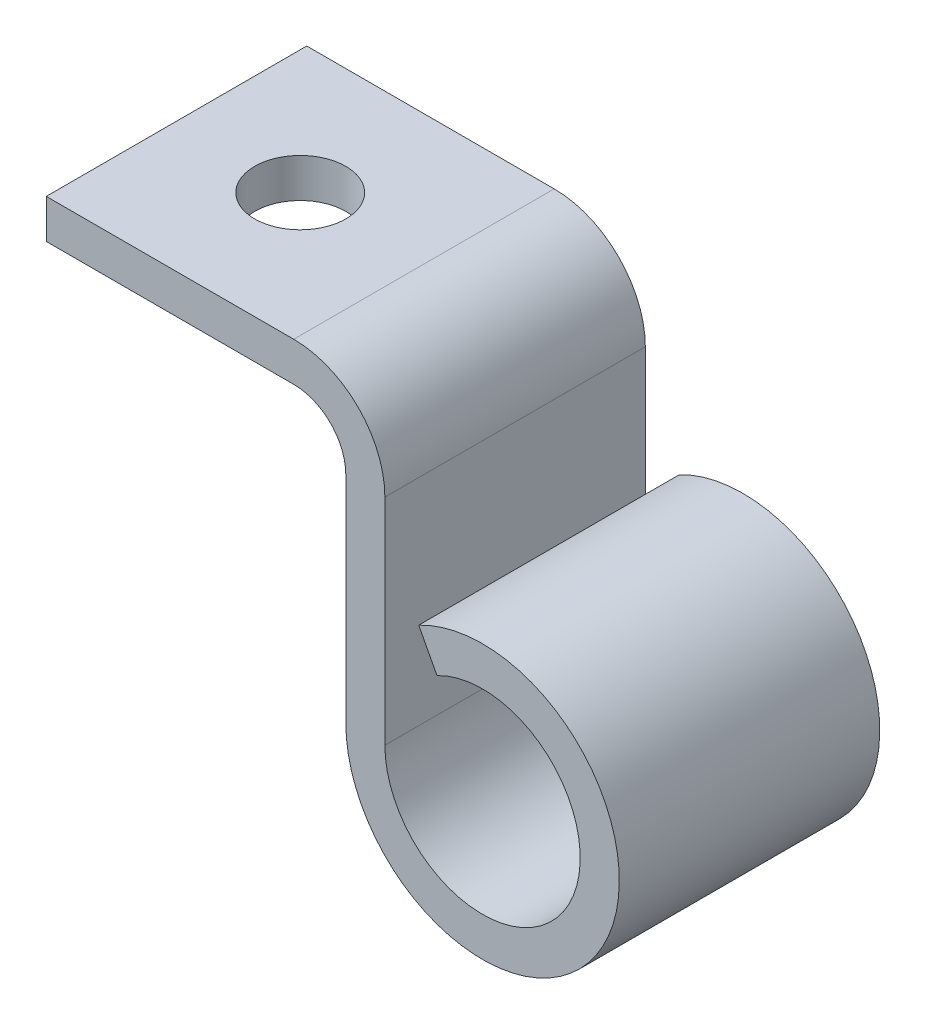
ISO-10303-21;
HEADER;
FILE_DESCRIPTION(('STEP AP214'),'2;1');
FILE_NAME('part.step','',(''),(''),'','','');
FILE_SCHEMA(('AUTOMOTIVE_DESIGN { 1 0 10303 214 1 1 1 1 }'));
ENDSEC;
DATA;
#1=APPLICATION_CONTEXT('core data for automotive mechanical design processes');
#2=APPLICATION_PROTOCOL_DEFINITION('international standard','automotive_design',2000,#1);
#3=PRODUCT_CONTEXT('',#1,'mechanical');
#4=PRODUCT('Part','Part','',(#3));
#5=PRODUCT_RELATED_PRODUCT_CATEGORY('part','',(#4));
#6=PRODUCT_DEFINITION_FORMATION('','',#4);
#7=PRODUCT_DEFINITION_CONTEXT('part definition',#1,'design');
#8=PRODUCT_DEFINITION('design','',#6,#7);
#9=PRODUCT_DEFINITION_SHAPE('','',#8);
#10=(LENGTH_UNIT() NAMED_UNIT(*) SI_UNIT(.MILLI.,.METRE.));
#11=(NAMED_UNIT(*) PLANE_ANGLE_UNIT() SI_UNIT($,.RADIAN.));
#12=(NAMED_UNIT(*) SI_UNIT($,.STERADIAN.) SOLID_ANGLE_UNIT());
#13=UNCERTAINTY_MEASURE_WITH_UNIT(LENGTH_MEASURE(1.E-05),#10,'distance_accuracy_value','');
#14=(GEOMETRIC_REPRESENTATION_CONTEXT(3) GLOBAL_UNCERTAINTY_ASSIGNED_CONTEXT((#13)) GLOBAL_UNIT_ASSIGNED_CONTEXT((#10,
#11,#12)) REPRESENTATION_CONTEXT('',''));
#15=CARTESIAN_POINT('',(0.,0.,0.));
#16=DIRECTION('',(0.,0.,1.));
#17=DIRECTION('',(1.,0.,0.));
#18=AXIS2_PLACEMENT_3D('',#15,#16,#17);
#19=CARTESIAN_POINT('',(0.,0.,10.));
#20=DIRECTION('',(0.,0.,-1.));
#21=DIRECTION('',(-1.,0.,0.));
#22=AXIS2_PLACEMENT_3D('',#19,#20,#21);
#23=CYLINDRICAL_SURFACE('',#22,10.5);
#24=CARTESIAN_POINT('',(0.,0.,-10.));
#25=DIRECTION('',(0.,0.,1.));
#26=DIRECTION('',(1.,0.,0.));
#27=AXIS2_PLACEMENT_3D('',#24,#25,#26);
#28=CIRCLE('',#27,10.5);
#29=CARTESIAN_POINT('',(-10.5,0.,-10.));
#30=VERTEX_POINT('',#29);
#31=CARTESIAN_POINT('',(-4.9,9.28654941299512,-10.));
#32=VERTEX_POINT('',#31);
#33=EDGE_CURVE('E139',#30,#32,#28,.T.);
#34=ORIENTED_EDGE('',*,*,#33,.T.);
#35=DIRECTION('',(0.,0.,-1.));
#36=VECTOR('',#35,1.);
#37=CARTESIAN_POINT('',(-4.9,9.28654941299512,10.));
#38=LINE('',#37,#36);
#39=CARTESIAN_POINT('',(-4.9,9.28654941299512,10.));
#40=VERTEX_POINT('',#39);
#41=EDGE_CURVE('E11',#40,#32,#38,.T.);
#42=ORIENTED_EDGE('',*,*,#41,.F.);
#43=CARTESIAN_POINT('',(0.,0.,10.));
#44=DIRECTION('',(0.,0.,1.));
#45=DIRECTION('',(1.,0.,0.));
#46=AXIS2_PLACEMENT_3D('',#43,#44,#45);
#47=CIRCLE('',#46,10.5);
#48=CARTESIAN_POINT('',(-10.5,0.,10.));
#49=VERTEX_POINT('',#48);
#50=EDGE_CURVE('E94',#49,#40,#47,.T.);
#51=ORIENTED_EDGE('',*,*,#50,.F.);
#52=DIRECTION('',(0.,0.,-1.));
#53=VECTOR('',#52,1.);
#54=CARTESIAN_POINT('',(-10.5,0.,10.));
#55=LINE('',#54,#53);
#56=EDGE_CURVE('E135',#49,#30,#55,.T.);
#57=ORIENTED_EDGE('',*,*,#56,.T.);
#58=EDGE_LOOP('',(#34,#42,#51,#57));
#59=FACE_BOUND('',#58,.T.);
#60=ADVANCED_FACE('F31',(#59),#23,.T.);
#61=CARTESIAN_POINT('',(-3.5,6.6332495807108,10.));
#62=DIRECTION('',(-0.884433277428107,-0.466666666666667,0.));
#63=DIRECTION('',(0.466666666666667,-0.884433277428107,0.));
#64=AXIS2_PLACEMENT_3D('',#61,#62,#63);
#65=PLANE('',#64);
#66=DIRECTION('',(-0.466666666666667,0.884433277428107,0.));
#67=VECTOR('',#66,1.);
#68=CARTESIAN_POINT('',(-3.5,6.6332495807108,-10.));
#69=LINE('',#68,#67);
#70=CARTESIAN_POINT('',(-3.5,6.6332495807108,-10.));
#71=VERTEX_POINT('',#70);
#72=EDGE_CURVE('E142',#71,#32,#69,.T.);
#73=ORIENTED_EDGE('',*,*,#72,.F.);
#74=DIRECTION('',(0.,0.,-1.));
#75=VECTOR('',#74,1.);
#76=CARTESIAN_POINT('',(-3.5,6.6332495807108,10.));
#77=LINE('',#76,#75);
#78=CARTESIAN_POINT('',(-3.5,6.6332495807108,10.));
#79=VERTEX_POINT('',#78);
#80=EDGE_CURVE('E40',#79,#71,#77,.T.);
#81=ORIENTED_EDGE('',*,*,#80,.F.);
#82=DIRECTION('',(-0.466666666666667,0.884433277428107,0.));
#83=VECTOR('',#82,1.);
#84=CARTESIAN_POINT('',(-3.5,6.6332495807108,10.));
#85=LINE('',#84,#83);
#86=EDGE_CURVE('E196',#79,#40,#85,.T.);
#87=ORIENTED_EDGE('',*,*,#86,.T.);
#88=ORIENTED_EDGE('',*,*,#41,.T.);
#89=EDGE_LOOP('',(#73,#81,#87,#88));
#90=FACE_BOUND('',#89,.T.);
#91=ADVANCED_FACE('F183',(#90),#65,.T.);
#92=CARTESIAN_POINT('',(0.,0.,10.));
#93=DIRECTION('',(0.,0.,-1.));
#94=DIRECTION('',(-1.,0.,0.));
#95=AXIS2_PLACEMENT_3D('',#92,#93,#94);
#96=CYLINDRICAL_SURFACE('',#95,7.5);
#97=CARTESIAN_POINT('',(0.,0.,-10.));
#98=DIRECTION('',(0.,0.,1.));
#99=DIRECTION('',(1.,0.,0.));
#100=AXIS2_PLACEMENT_3D('',#97,#98,#99);
#101=CIRCLE('',#100,7.5);
#102=CARTESIAN_POINT('',(-7.5,0.,-10.));
#103=VERTEX_POINT('',#102);
#104=EDGE_CURVE('E145',#103,#71,#101,.T.);
#105=ORIENTED_EDGE('',*,*,#104,.F.);
#106=DIRECTION('',(0.,0.,-1.));
#107=VECTOR('',#106,1.);
#108=CARTESIAN_POINT('',(-7.5,0.,10.));
#109=LINE('',#108,#107);
#110=CARTESIAN_POINT('',(-7.5,0.,10.));
#111=VERTEX_POINT('',#110);
#112=EDGE_CURVE('E172',#111,#103,#109,.T.);
#113=ORIENTED_EDGE('',*,*,#112,.F.);
#114=CARTESIAN_POINT('',(0.,0.,10.));
#115=DIRECTION('',(0.,0.,1.));
#116=DIRECTION('',(1.,0.,0.));
#117=AXIS2_PLACEMENT_3D('',#114,#115,#116);
#118=CIRCLE('',#117,7.5);
#119=EDGE_CURVE('E180',#111,#79,#118,.T.);
#120=ORIENTED_EDGE('',*,*,#119,.T.);
#121=ORIENTED_EDGE('',*,*,#80,.T.);
#122=EDGE_LOOP('',(#105,#113,#120,#121));
#123=FACE_BOUND('',#122,.T.);
#124=ADVANCED_FACE('F178',(#123),#96,.F.);
#125=CARTESIAN_POINT('',(-7.5,0.,10.));
#126=DIRECTION('',(1.,0.,0.));
#127=DIRECTION('',(0.,0.,-1.));
#128=AXIS2_PLACEMENT_3D('',#125,#126,#127);
#129=PLANE('',#128);
#130=DIRECTION('',(0.,-1.,0.));
#131=VECTOR('',#130,1.);
#132=CARTESIAN_POINT('',(-7.5,0.,-10.));
#133=LINE('',#132,#131);
#134=CARTESIAN_POINT('',(-7.5,16.5,-10.));
#135=VERTEX_POINT('',#134);
#136=EDGE_CURVE('E148',#135,#103,#133,.T.);
#137=ORIENTED_EDGE('',*,*,#136,.F.);
#138=DIRECTION('',(0.,0.,-1.));
#139=VECTOR('',#138,1.);
#140=CARTESIAN_POINT('',(-7.5,16.5,10.));
#141=LINE('',#140,#139);
#142=CARTESIAN_POINT('',(-7.5,16.5,10.));
#143=VERTEX_POINT('',#142);
#144=EDGE_CURVE('E170',#143,#135,#141,.T.);
#145=ORIENTED_EDGE('',*,*,#144,.F.);
#146=DIRECTION('',(0.,-1.,0.));
#147=VECTOR('',#146,1.);
#148=CARTESIAN_POINT('',(-7.5,0.,10.));
#149=LINE('',#148,#147);
#150=EDGE_CURVE('E193',#143,#111,#149,.T.);
#151=ORIENTED_EDGE('',*,*,#150,.T.);
#152=ORIENTED_EDGE('',*,*,#112,.T.);
#153=EDGE_LOOP('',(#137,#145,#151,#152));
#154=FACE_BOUND('',#153,.T.);
#155=ADVANCED_FACE('F190',(#154),#129,.T.);
#156=CARTESIAN_POINT('',(-14.5,16.5,10.));
#157=DIRECTION('',(0.,0.,-1.));
#158=DIRECTION('',(-1.,0.,0.));
#159=AXIS2_PLACEMENT_3D('',#156,#157,#158);
#160=CYLINDRICAL_SURFACE('',#159,7.);
#161=CARTESIAN_POINT('',(-14.5,16.5,-10.));
#162=DIRECTION('',(0.,0.,-1.));
#163=DIRECTION('',(1.,0.,0.));
#164=AXIS2_PLACEMENT_3D('',#161,#162,#163);
#165=CIRCLE('',#164,7.);
#166=CARTESIAN_POINT('',(-14.5,23.5,-10.));
#167=VERTEX_POINT('',#166);
#168=EDGE_CURVE('E151',#167,#135,#165,.T.);
#169=ORIENTED_EDGE('',*,*,#168,.F.);
#170=DIRECTION('',(0.,0.,-1.));
#171=VECTOR('',#170,1.);
#172=CARTESIAN_POINT('',(-14.5,23.5,10.));
#173=LINE('',#172,#171);
#174=CARTESIAN_POINT('',(-14.5,23.5,10.));
#175=VERTEX_POINT('',#174);
#176=EDGE_CURVE('E168',#175,#167,#173,.T.);
#177=ORIENTED_EDGE('',*,*,#176,.F.);
#178=CARTESIAN_POINT('',(-14.5,16.5,10.));
#179=DIRECTION('',(0.,0.,-1.));
#180=DIRECTION('',(1.,0.,0.));
#181=AXIS2_PLACEMENT_3D('',#178,#179,#180);
#182=CIRCLE('',#181,7.);
#183=EDGE_CURVE('E198',#175,#143,#182,.T.);
#184=ORIENTED_EDGE('',*,*,#183,.T.);
#185=ORIENTED_EDGE('',*,*,#144,.T.);
#186=EDGE_LOOP('',(#169,#177,#184,#185));
#187=FACE_BOUND('',#186,.T.);
#188=ADVANCED_FACE('F232',(#187),#160,.T.);
#189=CARTESIAN_POINT('',(-14.5,23.5,10.));
#190=DIRECTION('',(0.,1.,0.));
#191=DIRECTION('',(-1.,0.,0.));
#192=AXIS2_PLACEMENT_3D('',#189,#190,#191);
#193=PLANE('',#192);
#194=CARTESIAN_POINT('',(-24.,23.5,0.));
#195=DIRECTION('',(0.,1.,0.));
#196=DIRECTION('',(-1.,0.,0.));
#197=AXIS2_PLACEMENT_3D('',#194,#195,#196);
#198=CIRCLE('',#197,3.5);
#199=CARTESIAN_POINT('',(-27.5,23.5,0.));
#200=VERTEX_POINT('',#199);
#201=EDGE_CURVE('E250',#200,#200,#198,.T.);
#202=ORIENTED_EDGE('',*,*,#201,.F.);
#203=EDGE_LOOP('',(#202));
#204=FACE_BOUND('',#203,.T.);
#205=DIRECTION('',(1.,0.,0.));
#206=VECTOR('',#205,1.);
#207=CARTESIAN_POINT('',(-14.5,23.5,-10.));
#208=LINE('',#207,#206);
#209=CARTESIAN_POINT('',(-33.5,23.5,-10.));
#210=VERTEX_POINT('',#209);
#211=EDGE_CURVE('E154',#210,#167,#208,.T.);
#212=ORIENTED_EDGE('',*,*,#211,.F.);
#213=DIRECTION('',(0.,0.,-1.));
#214=VECTOR('',#213,1.);
#215=CARTESIAN_POINT('',(-33.5,23.5,10.));
#216=LINE('',#215,#214);
#217=CARTESIAN_POINT('',(-33.5,23.5,10.));
#218=VERTEX_POINT('',#217);
#219=EDGE_CURVE('E166',#218,#210,#216,.T.);
#220=ORIENTED_EDGE('',*,*,#219,.F.);
#221=DIRECTION('',(1.,0.,0.));
#222=VECTOR('',#221,1.);
#223=CARTESIAN_POINT('',(-14.5,23.5,10.));
#224=LINE('',#223,#222);
#225=EDGE_CURVE('E204',#218,#175,#224,.T.);
#226=ORIENTED_EDGE('',*,*,#225,.T.);
#227=ORIENTED_EDGE('',*,*,#176,.T.);
#228=EDGE_LOOP('',(#212,#220,#226,#227));
#229=FACE_BOUND('',#228,.T.);
#230=ADVANCED_FACE('F235',(#204,#229),#193,.T.);
#231=CARTESIAN_POINT('',(-33.5,20.5,10.));
#232=DIRECTION('',(-1.,0.,0.));
#233=DIRECTION('',(0.,0.,1.));
#234=AXIS2_PLACEMENT_3D('',#231,#232,#233);
#235=PLANE('',#234);
#236=DIRECTION('',(0.,1.,0.));
#237=VECTOR('',#236,1.);
#238=CARTESIAN_POINT('',(-33.5,20.5,-10.));
#239=LINE('',#238,#237);
#240=CARTESIAN_POINT('',(-33.5,20.5,-10.));
#241=VERTEX_POINT('',#240);
#242=EDGE_CURVE('E157',#241,#210,#239,.T.);
#243=ORIENTED_EDGE('',*,*,#242,.F.);
#244=DIRECTION('',(0.,0.,-1.));
#245=VECTOR('',#244,1.);
#246=CARTESIAN_POINT('',(-33.5,20.5,10.));
#247=LINE('',#246,#245);
#248=CARTESIAN_POINT('',(-33.5,20.5,10.));
#249=VERTEX_POINT('',#248);
#250=EDGE_CURVE('E130',#249,#241,#247,.T.);
#251=ORIENTED_EDGE('',*,*,#250,.F.);
#252=DIRECTION('',(0.,1.,0.));
#253=VECTOR('',#252,1.);
#254=CARTESIAN_POINT('',(-33.5,20.5,10.));
#255=LINE('',#254,#253);
#256=EDGE_CURVE('E123',#249,#218,#255,.T.);
#257=ORIENTED_EDGE('',*,*,#256,.T.);
#258=ORIENTED_EDGE('',*,*,#219,.T.);
#259=EDGE_LOOP('',(#243,#251,#257,#258));
#260=FACE_BOUND('',#259,.T.);
#261=ADVANCED_FACE('F208',(#260),#235,.T.);
#262=CARTESIAN_POINT('',(-14.5,20.5,10.));
#263=DIRECTION('',(0.,1.,0.));
#264=DIRECTION('',(-1.,0.,0.));
#265=AXIS2_PLACEMENT_3D('',#262,#263,#264);
#266=PLANE('',#265);
#267=CARTESIAN_POINT('',(-24.,20.5,0.));
#268=DIRECTION('',(0.,1.,0.));
#269=DIRECTION('',(-1.,0.,0.));
#270=AXIS2_PLACEMENT_3D('',#267,#268,#269);
#271=CIRCLE('',#270,3.5);
#272=CARTESIAN_POINT('',(-27.5,20.5,0.));
#273=VERTEX_POINT('',#272);
#274=EDGE_CURVE('E34',#273,#273,#271,.T.);
#275=ORIENTED_EDGE('',*,*,#274,.T.);
#276=EDGE_LOOP('',(#275));
#277=FACE_BOUND('',#276,.T.);
#278=DIRECTION('',(1.,0.,0.));
#279=VECTOR('',#278,1.);
#280=CARTESIAN_POINT('',(-14.5,20.5,-10.));
#281=LINE('',#280,#279);
#282=CARTESIAN_POINT('',(-14.5,20.5,-10.));
#283=VERTEX_POINT('',#282);
#284=EDGE_CURVE('E129',#241,#283,#281,.T.);
#285=ORIENTED_EDGE('',*,*,#284,.T.);
#286=DIRECTION('',(0.,0.,-1.));
#287=VECTOR('',#286,1.);
#288=CARTESIAN_POINT('',(-14.5,20.5,10.));
#289=LINE('',#288,#287);
#290=CARTESIAN_POINT('',(-14.5,20.5,10.));
#291=VERTEX_POINT('',#290);
#292=EDGE_CURVE('E126',#291,#283,#289,.T.);
#293=ORIENTED_EDGE('',*,*,#292,.F.);
#294=DIRECTION('',(1.,0.,0.));
#295=VECTOR('',#294,1.);
#296=CARTESIAN_POINT('',(-14.5,20.5,10.));
#297=LINE('',#296,#295);
#298=EDGE_CURVE('E116',#249,#291,#297,.T.);
#299=ORIENTED_EDGE('',*,*,#298,.F.);
#300=ORIENTED_EDGE('',*,*,#250,.T.);
#301=EDGE_LOOP('',(#285,#293,#299,#300));
#302=FACE_BOUND('',#301,.T.);
#303=ADVANCED_FACE('F127',(#277,#302),#266,.F.);
#304=CARTESIAN_POINT('',(-14.5,16.5,10.));
#305=DIRECTION('',(0.,0.,-1.));
#306=DIRECTION('',(-1.,0.,0.));
#307=AXIS2_PLACEMENT_3D('',#304,#305,#306);
#308=CYLINDRICAL_SURFACE('',#307,4.);
#309=CARTESIAN_POINT('',(-14.5,16.5,-10.));
#310=DIRECTION('',(0.,0.,1.));
#311=DIRECTION('',(1.,0.,0.));
#312=AXIS2_PLACEMENT_3D('',#309,#310,#311);
#313=CIRCLE('',#312,4.);
#314=CARTESIAN_POINT('',(-10.5,16.5,-10.));
#315=VERTEX_POINT('',#314);
#316=EDGE_CURVE('E82',#283,#315,#313,.F.);
#317=ORIENTED_EDGE('',*,*,#316,.T.);
#318=DIRECTION('',(0.,0.,-1.));
#319=VECTOR('',#318,1.);
#320=CARTESIAN_POINT('',(-10.5,16.5,10.));
#321=LINE('',#320,#319);
#322=CARTESIAN_POINT('',(-10.5,16.5,10.));
#323=VERTEX_POINT('',#322);
#324=EDGE_CURVE('E131',#323,#315,#321,.T.);
#325=ORIENTED_EDGE('',*,*,#324,.F.);
#326=CARTESIAN_POINT('',(-14.5,16.5,10.));
#327=DIRECTION('',(0.,0.,1.));
#328=DIRECTION('',(1.,0.,0.));
#329=AXIS2_PLACEMENT_3D('',#326,#327,#328);
#330=CIRCLE('',#329,4.);
#331=EDGE_CURVE('E120',#291,#323,#330,.F.);
#332=ORIENTED_EDGE('',*,*,#331,.F.);
#333=ORIENTED_EDGE('',*,*,#292,.T.);
#334=EDGE_LOOP('',(#317,#325,#332,#333));
#335=FACE_BOUND('',#334,.T.);
#336=ADVANCED_FACE('F133',(#335),#308,.F.);
#337=CARTESIAN_POINT('',(-10.5,0.,10.));
#338=DIRECTION('',(1.,0.,0.));
#339=DIRECTION('',(0.,0.,-1.));
#340=AXIS2_PLACEMENT_3D('',#337,#338,#339);
#341=PLANE('',#340);
#342=DIRECTION('',(0.,1.,0.));
#343=VECTOR('',#342,1.);
#344=CARTESIAN_POINT('',(-10.5,0.,-10.));
#345=LINE('',#344,#343);
#346=EDGE_CURVE('E88',#315,#30,#345,.F.);
#347=ORIENTED_EDGE('',*,*,#346,.T.);
#348=ORIENTED_EDGE('',*,*,#56,.F.);
#349=DIRECTION('',(0.,1.,0.));
#350=VECTOR('',#349,1.);
#351=CARTESIAN_POINT('',(-10.5,0.,10.));
#352=LINE('',#351,#350);
#353=EDGE_CURVE('E48',#323,#49,#352,.F.);
#354=ORIENTED_EDGE('',*,*,#353,.F.);
#355=ORIENTED_EDGE('',*,*,#324,.T.);
#356=EDGE_LOOP('',(#347,#348,#354,#355));
#357=FACE_BOUND('',#356,.T.);
#358=ADVANCED_FACE('F211',(#357),#341,.F.);
#359=CARTESIAN_POINT('',(0.,0.,10.));
#360=DIRECTION('',(0.,0.,1.));
#361=DIRECTION('',(1.,0.,0.));
#362=AXIS2_PLACEMENT_3D('',#359,#360,#361);
#363=PLANE('',#362);
#364=ORIENTED_EDGE('',*,*,#50,.T.);
#365=ORIENTED_EDGE('',*,*,#86,.F.);
#366=ORIENTED_EDGE('',*,*,#119,.F.);
#367=ORIENTED_EDGE('',*,*,#150,.F.);
#368=ORIENTED_EDGE('',*,*,#183,.F.);
#369=ORIENTED_EDGE('',*,*,#225,.F.);
#370=ORIENTED_EDGE('',*,*,#256,.F.);
#371=ORIENTED_EDGE('',*,*,#298,.T.);
#372=ORIENTED_EDGE('',*,*,#331,.T.);
#373=ORIENTED_EDGE('',*,*,#353,.T.);
#374=EDGE_LOOP('',(#364,#365,#366,#367,#368,#369,#370,#371,#372,#373));
#375=FACE_BOUND('',#374,.T.);
#376=ADVANCED_FACE('F118',(#375),#363,.T.);
#377=CARTESIAN_POINT('',(0.,0.,-10.));
#378=DIRECTION('',(0.,0.,1.));
#379=DIRECTION('',(1.,0.,0.));
#380=AXIS2_PLACEMENT_3D('',#377,#378,#379);
#381=PLANE('',#380);
#382=ORIENTED_EDGE('',*,*,#33,.F.);
#383=ORIENTED_EDGE('',*,*,#346,.F.);
#384=ORIENTED_EDGE('',*,*,#316,.F.);
#385=ORIENTED_EDGE('',*,*,#284,.F.);
#386=ORIENTED_EDGE('',*,*,#242,.T.);
#387=ORIENTED_EDGE('',*,*,#211,.T.);
#388=ORIENTED_EDGE('',*,*,#168,.T.);
#389=ORIENTED_EDGE('',*,*,#136,.T.);
#390=ORIENTED_EDGE('',*,*,#104,.T.);
#391=ORIENTED_EDGE('',*,*,#72,.T.);
#392=EDGE_LOOP('',(#382,#383,#384,#385,#386,#387,#388,#389,#390,#391));
#393=FACE_BOUND('',#392,.T.);
#394=ADVANCED_FACE('F186',(#393),#381,.F.);
#395=CARTESIAN_POINT('',(-24.,-10.5,0.));
#396=DIRECTION('',(0.,1.,0.));
#397=DIRECTION('',(-1.,0.,0.));
#398=AXIS2_PLACEMENT_3D('',#395,#396,#397);
#399=CYLINDRICAL_SURFACE('',#398,3.5);
#400=ORIENTED_EDGE('',*,*,#201,.T.);
#401=EDGE_LOOP('',(#400));
#402=FACE_BOUND('',#401,.T.);
#403=ORIENTED_EDGE('',*,*,#274,.F.);
#404=EDGE_LOOP('',(#403));
#405=FACE_BOUND('',#404,.T.);
#406=ADVANCED_FACE('F255',(#402,#405),#399,.F.);
#407=CLOSED_SHELL('',(#60,#91,#124,#155,#188,#230,#261,#303,#336,#358,#376,#394,#406));
#408=MANIFOLD_SOLID_BREP('B2',#407);
#409=ADVANCED_BREP_SHAPE_REPRESENTATION('',(#18,#408),#14);
#410=SHAPE_DEFINITION_REPRESENTATION(#9,#409);
ENDSEC;
END-ISO-10303-21;
